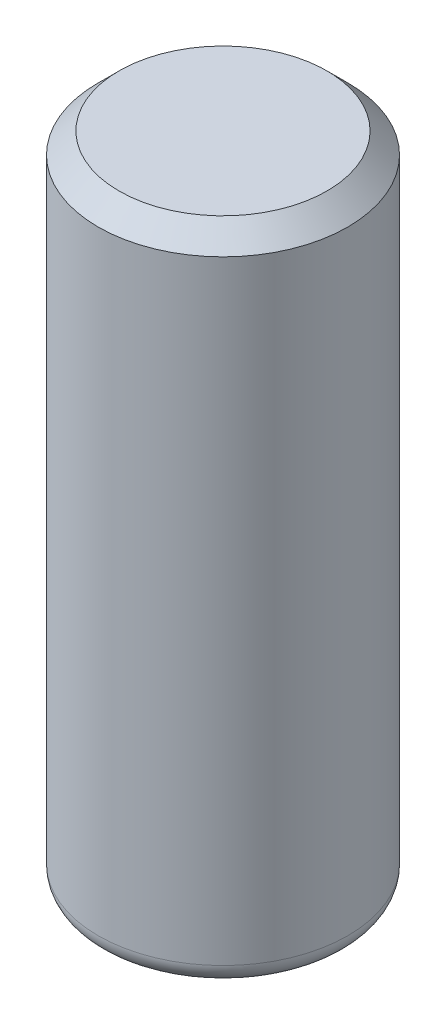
from build123d import *

# Parameters (mm, degrees)
SKETCH1_W     = 1.524
SKETCH1_H     = 8.001
FILLET1_R     = 0.254
CHAMFER1_SIZE = 0.254


with BuildPart() as part:
    # Sketch1 → Revolve1 (revolve)
    with BuildSketch(Plane.XY, mode=Mode.PRIVATE) as revolve1_sk:
        with Locations((-0.762, 4.0005)):
            Rectangle(SKETCH1_W, SKETCH1_H)
    revolve(revolve1_sk.sketch.rotate(Axis((0, 7.982954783, 0), (0, -1, 0)), 270), axis=Axis((0, 7.982954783, 0), (0, -1, 0)))

    # Fillet1
    fillet1_edges = [part.edges().sort_by_distance(p)[0] for p in [
        (0, 0, -1.524),
    ]]
    fillet(fillet1_edges, radius=FILLET1_R)

    # Chamfer1
    chamfer1_edges = [part.edges().sort_by_distance(p)[0] for p in [
        (0, 8.001, -1.524),
    ]]
    chamfer(chamfer1_edges, length=CHAMFER1_SIZE)


solid = part.part
